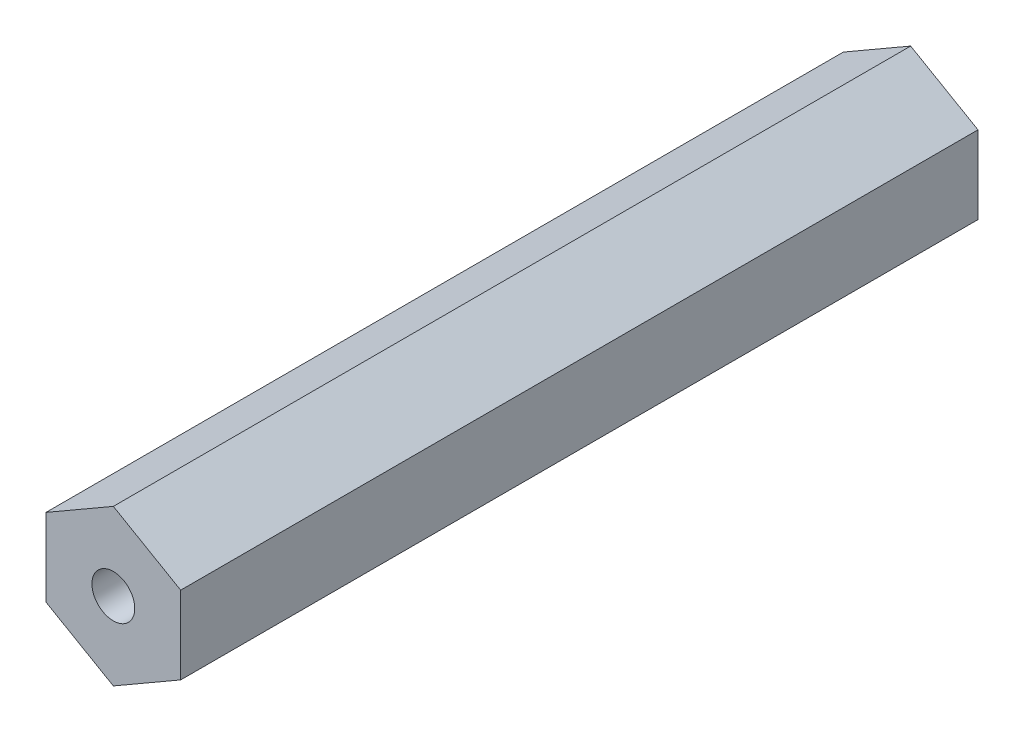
ISO-10303-21;
HEADER;
FILE_DESCRIPTION(('STEP AP214'),'2;1');
FILE_NAME('part.step','',(''),(''),'','','');
FILE_SCHEMA(('AUTOMOTIVE_DESIGN { 1 0 10303 214 1 1 1 1 }'));
ENDSEC;
DATA;
#1=APPLICATION_CONTEXT('core data for automotive mechanical design processes');
#2=APPLICATION_PROTOCOL_DEFINITION('international standard','automotive_design',2000,#1);
#3=PRODUCT_CONTEXT('',#1,'mechanical');
#4=PRODUCT('Part','Part','',(#3));
#5=PRODUCT_RELATED_PRODUCT_CATEGORY('part','',(#4));
#6=PRODUCT_DEFINITION_FORMATION('','',#4);
#7=PRODUCT_DEFINITION_CONTEXT('part definition',#1,'design');
#8=PRODUCT_DEFINITION('design','',#6,#7);
#9=PRODUCT_DEFINITION_SHAPE('','',#8);
#10=(LENGTH_UNIT() NAMED_UNIT(*) SI_UNIT(.MILLI.,.METRE.));
#11=(NAMED_UNIT(*) PLANE_ANGLE_UNIT() SI_UNIT($,.RADIAN.));
#12=(NAMED_UNIT(*) SI_UNIT($,.STERADIAN.) SOLID_ANGLE_UNIT());
#13=UNCERTAINTY_MEASURE_WITH_UNIT(LENGTH_MEASURE(1.E-05),#10,'distance_accuracy_value','');
#14=(GEOMETRIC_REPRESENTATION_CONTEXT(3) GLOBAL_UNCERTAINTY_ASSIGNED_CONTEXT((#13)) GLOBAL_UNIT_ASSIGNED_CONTEXT((#10,
#11,#12)) REPRESENTATION_CONTEXT('',''));
#15=CARTESIAN_POINT('',(0.,0.,0.));
#16=DIRECTION('',(0.,0.,1.));
#17=DIRECTION('',(1.,0.,0.));
#18=AXIS2_PLACEMENT_3D('',#15,#16,#17);
#19=CARTESIAN_POINT('',(6.35,3.66617420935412,75.184));
#20=DIRECTION('',(-0.5,-0.866025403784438,0.));
#21=DIRECTION('',(0.866025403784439,-0.5,0.));
#22=AXIS2_PLACEMENT_3D('',#19,#20,#21);
#23=PLANE('',#22);
#24=DIRECTION('',(-0.866025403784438,0.5,0.));
#25=VECTOR('',#24,1.);
#26=CARTESIAN_POINT('',(6.35,3.66617420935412,0.));
#27=LINE('',#26,#25);
#28=CARTESIAN_POINT('',(6.35,3.66617420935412,0.));
#29=VERTEX_POINT('',#28);
#30=CARTESIAN_POINT('',(0.,7.33234841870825,0.));
#31=VERTEX_POINT('',#30);
#32=EDGE_CURVE('E119',#29,#31,#27,.T.);
#33=ORIENTED_EDGE('',*,*,#32,.T.);
#34=DIRECTION('',(0.,0.,-1.));
#35=VECTOR('',#34,1.);
#36=CARTESIAN_POINT('',(0.,7.33234841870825,75.184));
#37=LINE('',#36,#35);
#38=CARTESIAN_POINT('',(0.,7.33234841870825,75.184));
#39=VERTEX_POINT('',#38);
#40=EDGE_CURVE('E11',#39,#31,#37,.T.);
#41=ORIENTED_EDGE('',*,*,#40,.F.);
#42=DIRECTION('',(-0.866025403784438,0.5,0.));
#43=VECTOR('',#42,1.);
#44=CARTESIAN_POINT('',(6.35,3.66617420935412,75.184));
#45=LINE('',#44,#43);
#46=CARTESIAN_POINT('',(6.35,3.66617420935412,75.184));
#47=VERTEX_POINT('',#46);
#48=EDGE_CURVE('E130',#47,#39,#45,.T.);
#49=ORIENTED_EDGE('',*,*,#48,.F.);
#50=DIRECTION('',(0.,0.,-1.));
#51=VECTOR('',#50,1.);
#52=CARTESIAN_POINT('',(6.35,3.66617420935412,75.184));
#53=LINE('',#52,#51);
#54=EDGE_CURVE('E115',#47,#29,#53,.T.);
#55=ORIENTED_EDGE('',*,*,#54,.T.);
#56=EDGE_LOOP('',(#33,#41,#49,#55));
#57=FACE_BOUND('',#56,.T.);
#58=ADVANCED_FACE('F32',(#57),#23,.F.);
#59=CARTESIAN_POINT('',(0.,7.33234841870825,75.184));
#60=DIRECTION('',(0.5,-0.866025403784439,0.));
#61=DIRECTION('',(0.866025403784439,0.5,0.));
#62=AXIS2_PLACEMENT_3D('',#59,#60,#61);
#63=PLANE('',#62);
#64=DIRECTION('',(-0.866025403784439,-0.5,0.));
#65=VECTOR('',#64,1.);
#66=CARTESIAN_POINT('',(0.,7.33234841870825,0.));
#67=LINE('',#66,#65);
#68=CARTESIAN_POINT('',(-6.35,3.66617420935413,0.));
#69=VERTEX_POINT('',#68);
#70=EDGE_CURVE('E122',#31,#69,#67,.T.);
#71=ORIENTED_EDGE('',*,*,#70,.T.);
#72=DIRECTION('',(0.,0.,-1.));
#73=VECTOR('',#72,1.);
#74=CARTESIAN_POINT('',(-6.35,3.66617420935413,75.184));
#75=LINE('',#74,#73);
#76=CARTESIAN_POINT('',(-6.35,3.66617420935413,75.184));
#77=VERTEX_POINT('',#76);
#78=EDGE_CURVE('E40',#77,#69,#75,.T.);
#79=ORIENTED_EDGE('',*,*,#78,.F.);
#80=DIRECTION('',(-0.866025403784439,-0.5,0.));
#81=VECTOR('',#80,1.);
#82=CARTESIAN_POINT('',(0.,7.33234841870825,75.184));
#83=LINE('',#82,#81);
#84=EDGE_CURVE('E86',#39,#77,#83,.T.);
#85=ORIENTED_EDGE('',*,*,#84,.F.);
#86=ORIENTED_EDGE('',*,*,#40,.T.);
#87=EDGE_LOOP('',(#71,#79,#85,#86));
#88=FACE_BOUND('',#87,.T.);
#89=ADVANCED_FACE('F155',(#88),#63,.F.);
#90=CARTESIAN_POINT('',(-6.35,3.66617420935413,75.184));
#91=DIRECTION('',(1.,0.,0.));
#92=DIRECTION('',(0.,1.,0.));
#93=AXIS2_PLACEMENT_3D('',#90,#91,#92);
#94=PLANE('',#93);
#95=DIRECTION('',(0.,-1.,0.));
#96=VECTOR('',#95,1.);
#97=CARTESIAN_POINT('',(-6.35,3.66617420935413,0.));
#98=LINE('',#97,#96);
#99=CARTESIAN_POINT('',(-6.35,-3.66617420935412,0.));
#100=VERTEX_POINT('',#99);
#101=EDGE_CURVE('E125',#69,#100,#98,.T.);
#102=ORIENTED_EDGE('',*,*,#101,.T.);
#103=DIRECTION('',(0.,0.,-1.));
#104=VECTOR('',#103,1.);
#105=CARTESIAN_POINT('',(-6.35,-3.66617420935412,75.184));
#106=LINE('',#105,#104);
#107=CARTESIAN_POINT('',(-6.35,-3.66617420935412,75.184));
#108=VERTEX_POINT('',#107);
#109=EDGE_CURVE('E110',#108,#100,#106,.T.);
#110=ORIENTED_EDGE('',*,*,#109,.F.);
#111=DIRECTION('',(0.,-1.,0.));
#112=VECTOR('',#111,1.);
#113=CARTESIAN_POINT('',(-6.35,3.66617420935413,75.184));
#114=LINE('',#113,#112);
#115=EDGE_CURVE('E101',#77,#108,#114,.T.);
#116=ORIENTED_EDGE('',*,*,#115,.F.);
#117=ORIENTED_EDGE('',*,*,#78,.T.);
#118=EDGE_LOOP('',(#102,#110,#116,#117));
#119=FACE_BOUND('',#118,.T.);
#120=ADVANCED_FACE('F136',(#119),#94,.F.);
#121=CARTESIAN_POINT('',(-6.35,-3.66617420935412,75.184));
#122=DIRECTION('',(0.5,0.866025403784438,0.));
#123=DIRECTION('',(-0.866025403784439,0.5,0.));
#124=AXIS2_PLACEMENT_3D('',#121,#122,#123);
#125=PLANE('',#124);
#126=DIRECTION('',(0.866025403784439,-0.5,0.));
#127=VECTOR('',#126,1.);
#128=CARTESIAN_POINT('',(-6.35,-3.66617420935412,0.));
#129=LINE('',#128,#127);
#130=CARTESIAN_POINT('',(0.,-7.33234841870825,0.));
#131=VERTEX_POINT('',#130);
#132=EDGE_CURVE('E109',#100,#131,#129,.T.);
#133=ORIENTED_EDGE('',*,*,#132,.T.);
#134=DIRECTION('',(0.,0.,-1.));
#135=VECTOR('',#134,1.);
#136=CARTESIAN_POINT('',(0.,-7.33234841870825,75.184));
#137=LINE('',#136,#135);
#138=CARTESIAN_POINT('',(0.,-7.33234841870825,75.184));
#139=VERTEX_POINT('',#138);
#140=EDGE_CURVE('E106',#139,#131,#137,.T.);
#141=ORIENTED_EDGE('',*,*,#140,.F.);
#142=DIRECTION('',(0.866025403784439,-0.5,0.));
#143=VECTOR('',#142,1.);
#144=CARTESIAN_POINT('',(-6.35,-3.66617420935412,75.184));
#145=LINE('',#144,#143);
#146=EDGE_CURVE('E95',#108,#139,#145,.T.);
#147=ORIENTED_EDGE('',*,*,#146,.F.);
#148=ORIENTED_EDGE('',*,*,#109,.T.);
#149=EDGE_LOOP('',(#133,#141,#147,#148));
#150=FACE_BOUND('',#149,.T.);
#151=ADVANCED_FACE('F107',(#150),#125,.F.);
#152=CARTESIAN_POINT('',(0.,-7.33234841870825,75.184));
#153=DIRECTION('',(-0.5,0.866025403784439,0.));
#154=DIRECTION('',(-0.866025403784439,-0.5,0.));
#155=AXIS2_PLACEMENT_3D('',#152,#153,#154);
#156=PLANE('',#155);
#157=DIRECTION('',(0.866025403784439,0.5,0.));
#158=VECTOR('',#157,1.);
#159=CARTESIAN_POINT('',(0.,-7.33234841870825,0.));
#160=LINE('',#159,#158);
#161=CARTESIAN_POINT('',(6.35,-3.66617420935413,0.));
#162=VERTEX_POINT('',#161);
#163=EDGE_CURVE('E72',#131,#162,#160,.T.);
#164=ORIENTED_EDGE('',*,*,#163,.T.);
#165=DIRECTION('',(0.,0.,-1.));
#166=VECTOR('',#165,1.);
#167=CARTESIAN_POINT('',(6.35,-3.66617420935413,75.184));
#168=LINE('',#167,#166);
#169=CARTESIAN_POINT('',(6.35,-3.66617420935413,75.184));
#170=VERTEX_POINT('',#169);
#171=EDGE_CURVE('E111',#170,#162,#168,.T.);
#172=ORIENTED_EDGE('',*,*,#171,.F.);
#173=DIRECTION('',(0.866025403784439,0.5,0.));
#174=VECTOR('',#173,1.);
#175=CARTESIAN_POINT('',(0.,-7.33234841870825,75.184));
#176=LINE('',#175,#174);
#177=EDGE_CURVE('E99',#139,#170,#176,.T.);
#178=ORIENTED_EDGE('',*,*,#177,.F.);
#179=ORIENTED_EDGE('',*,*,#140,.T.);
#180=EDGE_LOOP('',(#164,#172,#178,#179));
#181=FACE_BOUND('',#180,.T.);
#182=ADVANCED_FACE('F113',(#181),#156,.F.);
#183=CARTESIAN_POINT('',(6.35,-3.66617420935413,75.184));
#184=DIRECTION('',(-1.,0.,0.));
#185=DIRECTION('',(0.,-1.,0.));
#186=AXIS2_PLACEMENT_3D('',#183,#184,#185);
#187=PLANE('',#186);
#188=DIRECTION('',(0.,1.,0.));
#189=VECTOR('',#188,1.);
#190=CARTESIAN_POINT('',(6.35,-3.66617420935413,0.));
#191=LINE('',#190,#189);
#192=EDGE_CURVE('E78',#162,#29,#191,.T.);
#193=ORIENTED_EDGE('',*,*,#192,.T.);
#194=ORIENTED_EDGE('',*,*,#54,.F.);
#195=DIRECTION('',(0.,1.,0.));
#196=VECTOR('',#195,1.);
#197=CARTESIAN_POINT('',(6.35,-3.66617420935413,75.184));
#198=LINE('',#197,#196);
#199=EDGE_CURVE('E48',#170,#47,#198,.T.);
#200=ORIENTED_EDGE('',*,*,#199,.F.);
#201=ORIENTED_EDGE('',*,*,#171,.T.);
#202=EDGE_LOOP('',(#193,#194,#200,#201));
#203=FACE_BOUND('',#202,.T.);
#204=ADVANCED_FACE('F143',(#203),#187,.F.);
#205=CARTESIAN_POINT('',(0.,0.,75.184));
#206=DIRECTION('',(0.,0.,1.));
#207=DIRECTION('',(1.,0.,0.));
#208=AXIS2_PLACEMENT_3D('',#205,#206,#207);
#209=PLANE('',#208);
#210=CARTESIAN_POINT('',(0.,0.,75.184));
#211=DIRECTION('',(0.,0.,1.));
#212=DIRECTION('',(1.,0.,0.));
#213=AXIS2_PLACEMENT_3D('',#210,#211,#212);
#214=CIRCLE('',#213,2.01929999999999);
#215=CARTESIAN_POINT('',(2.01929999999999,0.,75.184));
#216=VERTEX_POINT('',#215);
#217=EDGE_CURVE('E241',#216,#216,#214,.T.);
#218=ORIENTED_EDGE('',*,*,#217,.F.);
#219=EDGE_LOOP('',(#218));
#220=FACE_BOUND('',#219,.T.);
#221=ORIENTED_EDGE('',*,*,#48,.T.);
#222=ORIENTED_EDGE('',*,*,#84,.T.);
#223=ORIENTED_EDGE('',*,*,#115,.T.);
#224=ORIENTED_EDGE('',*,*,#146,.T.);
#225=ORIENTED_EDGE('',*,*,#177,.T.);
#226=ORIENTED_EDGE('',*,*,#199,.T.);
#227=EDGE_LOOP('',(#221,#222,#223,#224,#225,#226));
#228=FACE_BOUND('',#227,.T.);
#229=ADVANCED_FACE('F97',(#220,#228),#209,.T.);
#230=CARTESIAN_POINT('',(0.,0.,0.));
#231=DIRECTION('',(0.,0.,1.));
#232=DIRECTION('',(1.,0.,0.));
#233=AXIS2_PLACEMENT_3D('',#230,#231,#232);
#234=PLANE('',#233);
#235=CARTESIAN_POINT('',(0.,0.,0.));
#236=DIRECTION('',(0.,0.,-1.));
#237=DIRECTION('',(-1.,0.,0.));
#238=AXIS2_PLACEMENT_3D('',#235,#236,#237);
#239=CIRCLE('',#238,2.01929999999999);
#240=CARTESIAN_POINT('',(-2.01929999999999,0.,0.));
#241=VERTEX_POINT('',#240);
#242=EDGE_CURVE('E243',#241,#241,#239,.T.);
#243=ORIENTED_EDGE('',*,*,#242,.F.);
#244=EDGE_LOOP('',(#243));
#245=FACE_BOUND('',#244,.T.);
#246=ORIENTED_EDGE('',*,*,#32,.F.);
#247=ORIENTED_EDGE('',*,*,#192,.F.);
#248=ORIENTED_EDGE('',*,*,#163,.F.);
#249=ORIENTED_EDGE('',*,*,#132,.F.);
#250=ORIENTED_EDGE('',*,*,#101,.F.);
#251=ORIENTED_EDGE('',*,*,#70,.F.);
#252=EDGE_LOOP('',(#246,#247,#248,#249,#250,#251));
#253=FACE_BOUND('',#252,.T.);
#254=ADVANCED_FACE('F139',(#245,#253),#234,.F.);
#255=CARTESIAN_POINT('',(0.,0.,12.7));
#256=DIRECTION('',(0.,0.,-1.));
#257=DIRECTION('',(-1.,0.,0.));
#258=AXIS2_PLACEMENT_3D('',#255,#256,#257);
#259=CONICAL_SURFACE('',#258,2.01929999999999,1.02974425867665);
#260=CARTESIAN_POINT('',(0.,0.,13.9133178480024));
#261=VERTEX_POINT('',#260);
#262=VERTEX_LOOP('',#261);
#263=FACE_BOUND('',#262,.T.);
#264=CARTESIAN_POINT('',(0.,0.,12.7));
#265=DIRECTION('',(0.,0.,-1.));
#266=DIRECTION('',(-1.,0.,0.));
#267=AXIS2_PLACEMENT_3D('',#264,#265,#266);
#268=CIRCLE('',#267,2.01929999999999);
#269=CARTESIAN_POINT('',(-2.01929999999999,0.,12.7));
#270=VERTEX_POINT('',#269);
#271=EDGE_CURVE('E123',#270,#270,#268,.T.);
#272=ORIENTED_EDGE('',*,*,#271,.T.);
#273=EDGE_LOOP('',(#272));
#274=FACE_BOUND('',#273,.T.);
#275=ADVANCED_FACE('F187',(#263,#274),#259,.F.);
#276=CARTESIAN_POINT('',(0.,0.,0.));
#277=DIRECTION('',(0.,0.,-1.));
#278=DIRECTION('',(-1.,0.,0.));
#279=AXIS2_PLACEMENT_3D('',#276,#277,#278);
#280=CYLINDRICAL_SURFACE('',#279,2.01929999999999);
#281=ORIENTED_EDGE('',*,*,#271,.F.);
#282=EDGE_LOOP('',(#281));
#283=FACE_BOUND('',#282,.T.);
#284=ORIENTED_EDGE('',*,*,#242,.T.);
#285=EDGE_LOOP('',(#284));
#286=FACE_BOUND('',#285,.T.);
#287=ADVANCED_FACE('F196',(#283,#286),#280,.F.);
#288=CARTESIAN_POINT('',(0.,0.,62.484));
#289=DIRECTION('',(0.,0.,1.));
#290=DIRECTION('',(1.,0.,0.));
#291=AXIS2_PLACEMENT_3D('',#288,#289,#290);
#292=CONICAL_SURFACE('',#291,2.01929999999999,1.02974425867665);
#293=CARTESIAN_POINT('',(0.,0.,61.2706821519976));
#294=VERTEX_POINT('',#293);
#295=VERTEX_LOOP('',#294);
#296=FACE_BOUND('',#295,.T.);
#297=CARTESIAN_POINT('',(0.,0.,62.484));
#298=DIRECTION('',(0.,0.,1.));
#299=DIRECTION('',(1.,0.,0.));
#300=AXIS2_PLACEMENT_3D('',#297,#298,#299);
#301=CIRCLE('',#300,2.01929999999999);
#302=CARTESIAN_POINT('',(2.01929999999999,0.,62.484));
#303=VERTEX_POINT('',#302);
#304=EDGE_CURVE('E238',#303,#303,#301,.T.);
#305=ORIENTED_EDGE('',*,*,#304,.T.);
#306=EDGE_LOOP('',(#305));
#307=FACE_BOUND('',#306,.T.);
#308=ADVANCED_FACE('F206',(#296,#307),#292,.F.);
#309=CARTESIAN_POINT('',(0.,0.,75.184));
#310=DIRECTION('',(0.,0.,1.));
#311=DIRECTION('',(1.,0.,0.));
#312=AXIS2_PLACEMENT_3D('',#309,#310,#311);
#313=CYLINDRICAL_SURFACE('',#312,2.01929999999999);
#314=ORIENTED_EDGE('',*,*,#304,.F.);
#315=EDGE_LOOP('',(#314));
#316=FACE_BOUND('',#315,.T.);
#317=ORIENTED_EDGE('',*,*,#217,.T.);
#318=EDGE_LOOP('',(#317));
#319=FACE_BOUND('',#318,.T.);
#320=ADVANCED_FACE('F221',(#316,#319),#313,.F.);
#321=CLOSED_SHELL('',(#58,#89,#120,#151,#182,#204,#229,#254,#275,#287,#308,#320));
#322=MANIFOLD_SOLID_BREP('B2',#321);
#323=ADVANCED_BREP_SHAPE_REPRESENTATION('',(#18,#322),#14);
#324=SHAPE_DEFINITION_REPRESENTATION(#9,#323);
ENDSEC;
END-ISO-10303-21;
